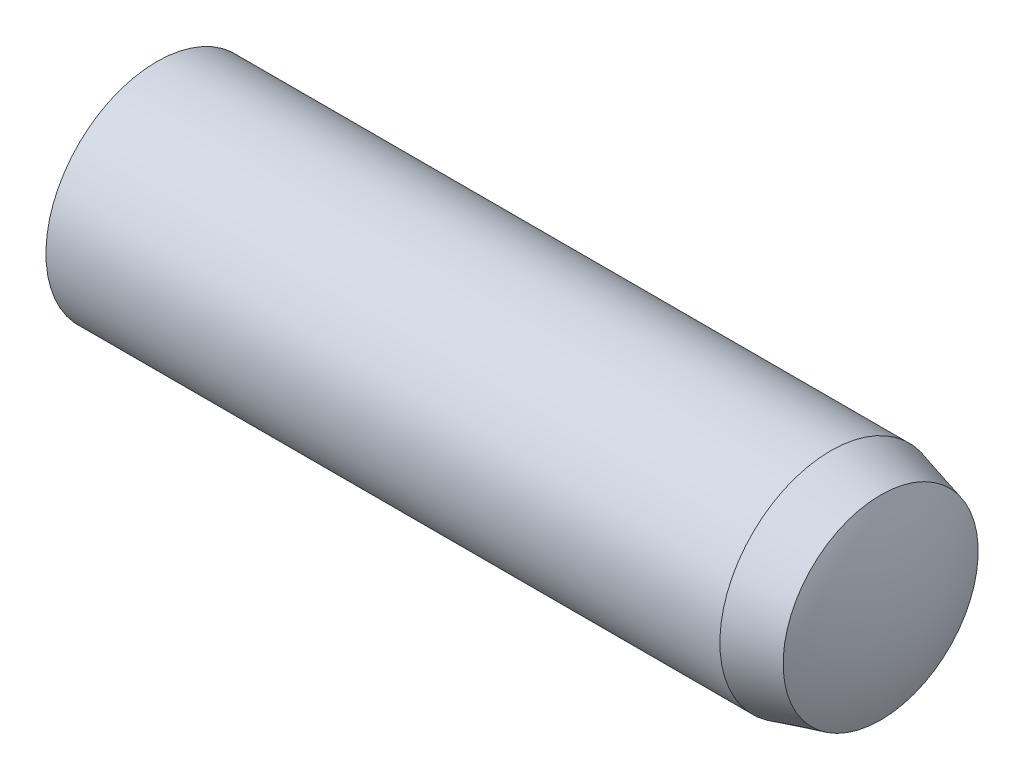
ISO-10303-21;
HEADER;
FILE_DESCRIPTION(('STEP AP214'),'2;1');
FILE_NAME('part.step','',(''),(''),'','','');
FILE_SCHEMA(('AUTOMOTIVE_DESIGN { 1 0 10303 214 1 1 1 1 }'));
ENDSEC;
DATA;
#1=APPLICATION_CONTEXT('core data for automotive mechanical design processes');
#2=APPLICATION_PROTOCOL_DEFINITION('international standard','automotive_design',2000,#1);
#3=PRODUCT_CONTEXT('',#1,'mechanical');
#4=PRODUCT('Part','Part','',(#3));
#5=PRODUCT_RELATED_PRODUCT_CATEGORY('part','',(#4));
#6=PRODUCT_DEFINITION_FORMATION('','',#4);
#7=PRODUCT_DEFINITION_CONTEXT('part definition',#1,'design');
#8=PRODUCT_DEFINITION('design','',#6,#7);
#9=PRODUCT_DEFINITION_SHAPE('','',#8);
#10=(LENGTH_UNIT() NAMED_UNIT(*) SI_UNIT(.MILLI.,.METRE.));
#11=(NAMED_UNIT(*) PLANE_ANGLE_UNIT() SI_UNIT($,.RADIAN.));
#12=(NAMED_UNIT(*) SI_UNIT($,.STERADIAN.) SOLID_ANGLE_UNIT());
#13=UNCERTAINTY_MEASURE_WITH_UNIT(LENGTH_MEASURE(1.E-05),#10,'distance_accuracy_value','');
#14=(GEOMETRIC_REPRESENTATION_CONTEXT(3) GLOBAL_UNCERTAINTY_ASSIGNED_CONTEXT((#13)) GLOBAL_UNIT_ASSIGNED_CONTEXT((#10,
#11,#12)) REPRESENTATION_CONTEXT('',''));
#15=CARTESIAN_POINT('',(0.,0.,0.));
#16=DIRECTION('',(0.,0.,1.));
#17=DIRECTION('',(1.,0.,0.));
#18=AXIS2_PLACEMENT_3D('',#15,#16,#17);
#19=CARTESIAN_POINT('',(20.,0.,0.));
#20=DIRECTION('',(1.,0.,0.));
#21=DIRECTION('',(0.,1.,0.));
#22=AXIS2_PLACEMENT_3D('',#19,#20,#21);
#23=SPHERICAL_SURFACE('',#22,8.);
#24=CARTESIAN_POINT('',(28.,0.,0.));
#25=VERTEX_POINT('',#24);
#26=VERTEX_LOOP('',#25);
#27=FACE_BOUND('',#26,.T.);
#28=CARTESIAN_POINT('',(27.1851128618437,0.,0.));
#29=DIRECTION('',(-1.,0.,0.));
#30=DIRECTION('',(0.,1.,0.));
#31=AXIS2_PLACEMENT_3D('',#28,#29,#30);
#32=CIRCLE('',#31,3.5176914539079);
#33=CARTESIAN_POINT('',(27.1851128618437,3.5176914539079,0.));
#34=VERTEX_POINT('',#33);
#35=EDGE_CURVE('E37',#34,#34,#32,.T.);
#36=ORIENTED_EDGE('',*,*,#35,.F.);
#37=EDGE_LOOP('',(#36));
#38=FACE_BOUND('',#37,.T.);
#39=ADVANCED_FACE('F17',(#27,#38),#23,.T.);
#40=CARTESIAN_POINT('',(25.3851128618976,0.,0.));
#41=DIRECTION('',(-1.,0.,0.));
#42=DIRECTION('',(0.,0.,1.));
#43=AXIS2_PLACEMENT_3D('',#40,#41,#42);
#44=CONICAL_SURFACE('',#43,3.99999999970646,0.261799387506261);
#45=CARTESIAN_POINT('',(25.3851128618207,0.,0.));
#46=DIRECTION('',(1.,0.,0.));
#47=DIRECTION('',(0.,0.,-1.));
#48=AXIS2_PLACEMENT_3D('',#45,#46,#47);
#49=CIRCLE('',#48,4.);
#50=CARTESIAN_POINT('',(25.3851128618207,0.,-4.));
#51=VERTEX_POINT('',#50);
#52=EDGE_CURVE('E26',#51,#51,#49,.F.);
#53=ORIENTED_EDGE('',*,*,#52,.F.);
#54=EDGE_LOOP('',(#53));
#55=FACE_BOUND('',#54,.T.);
#56=ORIENTED_EDGE('',*,*,#35,.T.);
#57=EDGE_LOOP('',(#56));
#58=FACE_BOUND('',#57,.T.);
#59=ADVANCED_FACE('F34',(#55,#58),#44,.T.);
#60=CARTESIAN_POINT('',(8.,0.,0.));
#61=DIRECTION('',(1.,0.,0.));
#62=DIRECTION('',(0.,1.,0.));
#63=AXIS2_PLACEMENT_3D('',#60,#61,#62);
#64=SPHERICAL_SURFACE('',#63,8.);
#65=CARTESIAN_POINT('',(0.,0.,0.));
#66=VERTEX_POINT('',#65);
#67=VERTEX_LOOP('',#66);
#68=FACE_BOUND('',#67,.T.);
#69=CARTESIAN_POINT('',(1.07179676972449,0.,0.));
#70=DIRECTION('',(1.,0.,0.));
#71=DIRECTION('',(0.,0.,-1.));
#72=AXIS2_PLACEMENT_3D('',#69,#70,#71);
#73=CIRCLE('',#72,4.);
#74=CARTESIAN_POINT('',(1.07179676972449,0.,-4.));
#75=VERTEX_POINT('',#74);
#76=EDGE_CURVE('E11',#75,#75,#73,.T.);
#77=ORIENTED_EDGE('',*,*,#76,.F.);
#78=EDGE_LOOP('',(#77));
#79=FACE_BOUND('',#78,.T.);
#80=ADVANCED_FACE('F48',(#68,#79),#64,.T.);
#81=CARTESIAN_POINT('',(13.2284548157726,0.,0.));
#82=DIRECTION('',(1.,0.,0.));
#83=DIRECTION('',(0.,0.,-1.));
#84=AXIS2_PLACEMENT_3D('',#81,#82,#83);
#85=CYLINDRICAL_SURFACE('',#84,4.);
#86=ORIENTED_EDGE('',*,*,#76,.T.);
#87=EDGE_LOOP('',(#86));
#88=FACE_BOUND('',#87,.T.);
#89=ORIENTED_EDGE('',*,*,#52,.T.);
#90=EDGE_LOOP('',(#89));
#91=FACE_BOUND('',#90,.T.);
#92=ADVANCED_FACE('F51',(#88,#91),#85,.T.);
#93=CLOSED_SHELL('',(#39,#59,#80,#92));
#94=MANIFOLD_SOLID_BREP('B1',#93);
#95=ADVANCED_BREP_SHAPE_REPRESENTATION('',(#18,#94),#14);
#96=SHAPE_DEFINITION_REPRESENTATION(#9,#95);
ENDSEC;
END-ISO-10303-21;
